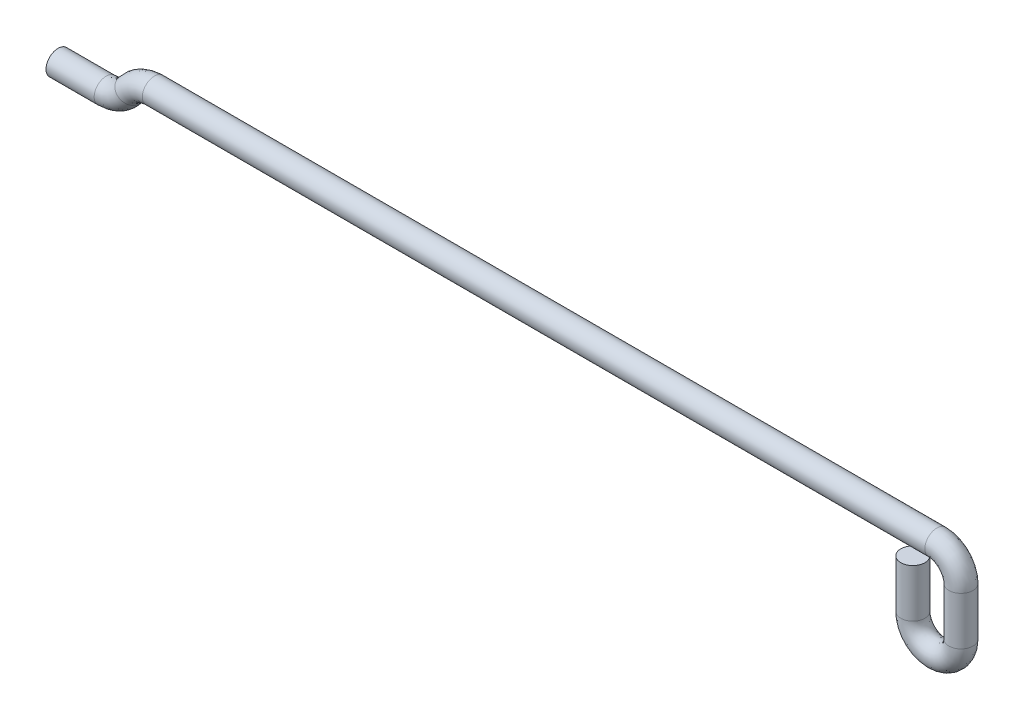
from build123d import *

# Parameters (mm, degrees)
SKETCH3_R = 0.79375


with BuildPart() as part:
    # Sweep2: sweep along a curve in space
    with BuildLine() as sweep2_path:
        Line((-3.175, -2.647588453, 0), (-3.175, -5.822588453, 0))
        ThreePointArc((-3.175, -5.822588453, 0), (-1.5875, -7.410088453, 0), (0, -5.822588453, 0))
        Line((0, -5.822588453, 0), (0, -2.647588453, 0))
        ThreePointArc((0, -2.647588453, 0), (-0.464967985, -1.525056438, 0), (-1.5875, -1.060088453, 0))
        Line((-1.5875, -1.060088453, 0), (-53.181504, -1.060088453, 0))
        ThreePointArc((-53.181504, -1.060088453, 0), (-54.068943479, -1.269584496, 0), (-54.769004, -1.853838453, 0))
        ThreePointArc((-54.769004, -1.853838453, 0), (-55.46905722, -2.438262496, 0), (-56.356504, -2.648177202, 0))
        Line((-56.356504, -2.648177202, 0), (-59.531504, -2.648177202, 0))
    # Sketch3 → Sweep2 (sweep)
    with BuildSketch(Plane(origin=(-59.531504, -2.648177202, 0), x_dir=(0, 0, 1), z_dir=(-1, 0, 0))):
        with Locations((0, -0.000305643)):
            Circle(SKETCH3_R)
    sweep(path=sweep2_path.line, transition=Transition.RIGHT)


solid = part.part
